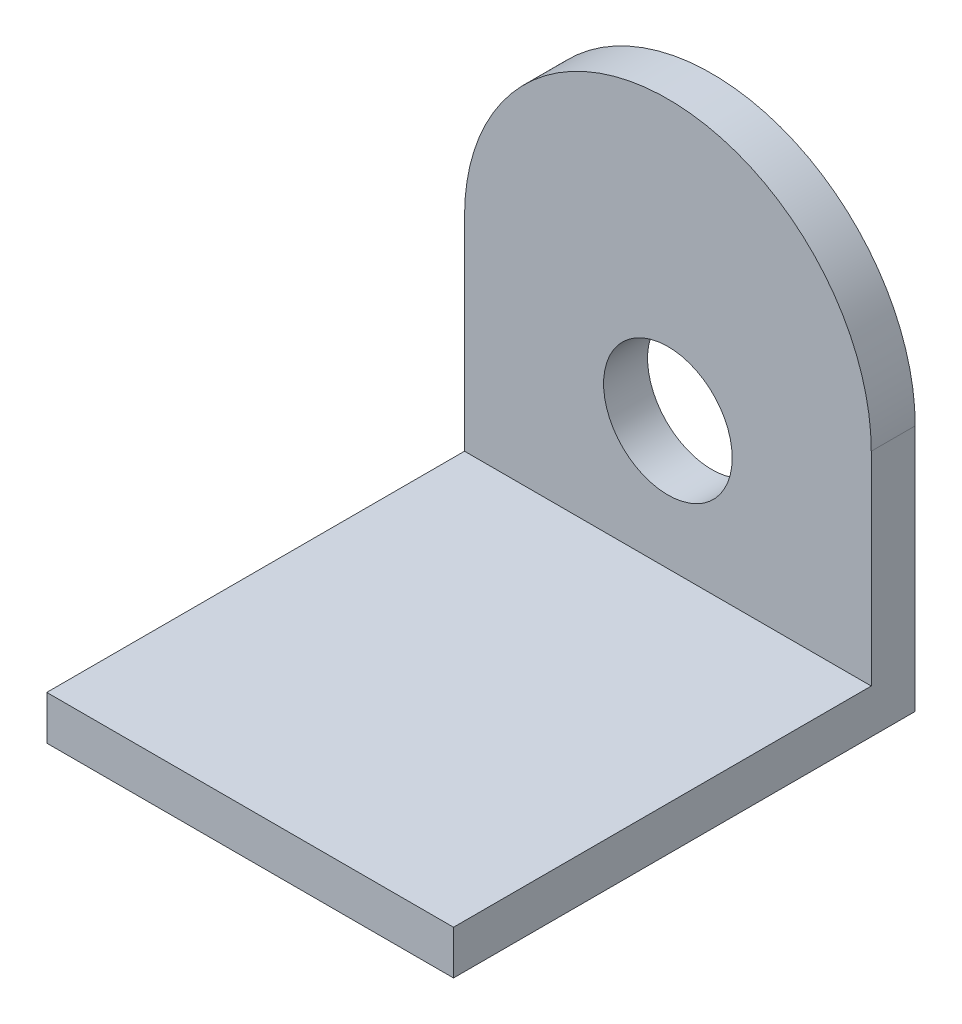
from build123d import *

# Parameters (mm, degrees)
SKETCH1_R           = 5.85
BOSS_EXTRUDE1_DEPTH = 4
SKETCH2_W           = 37
SKETCH2_H           = 4
BOSS_EXTRUDE2_DEPTH = 42


with BuildPart() as part:
    # Sketch1 → Boss-Extrude1 (new body)
    with BuildSketch(Plane.XY):
        with BuildLine():
            Line((-46.110395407, -22.5), (-9.110395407, -22.5))
            Line((-9.110395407, -22.5), (-9.110395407, 0))
            ThreePointArc((-9.110395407, 0), (-27.610395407, 18.5), (-46.110395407, 0))
            Line((-46.110395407, 0), (-46.110395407, -22.5))
        make_face()
        with Locations((-27.610395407, -6.85)):
            Circle(SKETCH1_R, mode=Mode.SUBTRACT)
    extrude(amount=BOSS_EXTRUDE1_DEPTH)

    # Sketch2 → Boss-Extrude2 (add)
    with BuildSketch(Plane.XY):
        with Locations((-27.610395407, -20.5)):
            Rectangle(SKETCH2_W, SKETCH2_H)
    extrude(amount=BOSS_EXTRUDE2_DEPTH)


solid = part.part
